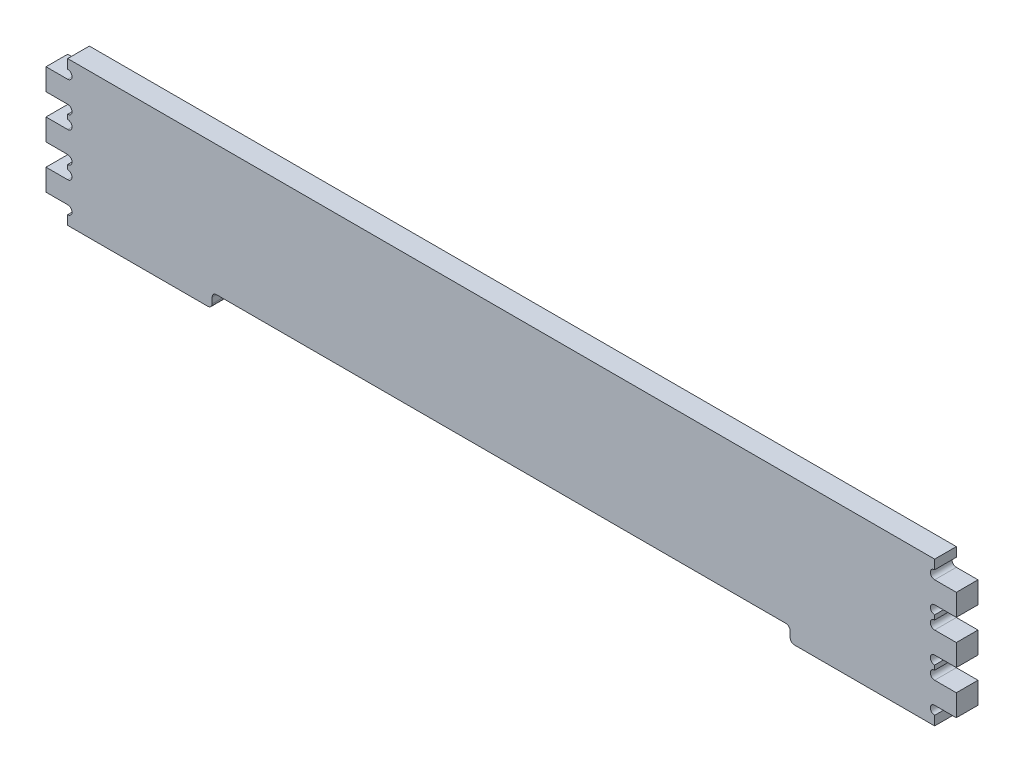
from build123d import *

# Parameters (mm, degrees)
AUFSATZ_LINEAR_AUSTRAGEN1_DEPTH = 15
VERRUNDUNG1_R                   = 3


with BuildPart() as part:
    # Skizze1 → Aufsatz-Linear austragen1 (new body)
    with BuildSketch(Plane.XY):
        with BuildLine():
            Line((-15, 12.4), (0, 12.4))
            ThreePointArc((0, 12.4), (3, 9.4), (0, 6.4))
            Line((0, 6.4), (0, 0))
            Line((0, 0), (100, 0))
            Line((100, 0), (100, 10))
            Line((100, 10), (500, 10))
            Line((500, 10), (500, 0))
            Line((500, 0), (600, 0))
            Line((600, 0), (600, 6.4))
            ThreePointArc((600, 6.4), (597, 9.4), (600, 12.4))
            Line((600, 12.4), (615, 12.4))
            Line((615, 12.4), (615, 27.4))
            Line((615, 27.4), (600, 27.4))
            ThreePointArc((600, 27.4), (597, 30.4), (600, 33.4))
            Line((600, 33.4), (600, 36.5))
            ThreePointArc((600, 36.5), (597, 39.5), (600, 42.5))
            Line((600, 42.5), (615, 42.5))
            Line((615, 42.5), (615, 57.5))
            Line((615, 57.5), (600, 57.5))
            ThreePointArc((600, 57.5), (597, 60.5), (600, 63.5))
            Line((600, 63.5), (600, 66.6))
            ThreePointArc((600, 66.6), (597, 69.6), (600, 72.6))
            Line((600, 72.6), (615, 72.6))
            Line((615, 72.6), (615, 87.6))
            Line((615, 87.6), (600, 87.6))
            ThreePointArc((600, 87.6), (597, 90.6), (600, 93.6))
            Line((600, 93.6), (600, 100))
            Line((600, 100), (0, 100))
            Line((0, 100), (0, 93.6))
            ThreePointArc((0, 93.6), (3, 90.6), (0, 87.6))
            Line((0, 87.6), (-15, 87.6))
            Line((-15, 87.6), (-15, 72.6))
            Line((-15, 72.6), (0, 72.6))
            ThreePointArc((0, 72.6), (3, 69.6), (0, 66.6))
            Line((0, 66.6), (0, 63.5))
            ThreePointArc((0, 63.5), (3, 60.5), (0, 57.5))
            Line((0, 57.5), (-15, 57.5))
            Line((-15, 57.5), (-15, 42.5))
            Line((-15, 42.5), (0, 42.5))
            ThreePointArc((0, 42.5), (3, 39.5), (0, 36.5))
            Line((0, 36.5), (0, 33.4))
            ThreePointArc((0, 33.4), (3, 30.4), (0, 27.4))
            Line((0, 27.4), (-15, 27.4))
            Line((-15, 27.4), (-15, 12.4))
        make_face()
    extrude(amount=AUFSATZ_LINEAR_AUSTRAGEN1_DEPTH)

    # Verrundung1
    verrundung1_edges = [part.edges().sort_by_distance(p)[0] for p in [
        (100, 0, 7.5),
        (100, 10, 7.5),
        (500, 10, 7.5),
        (500, 0, 7.5),
    ]]
    fillet(verrundung1_edges, radius=VERRUNDUNG1_R)


solid = part.part
